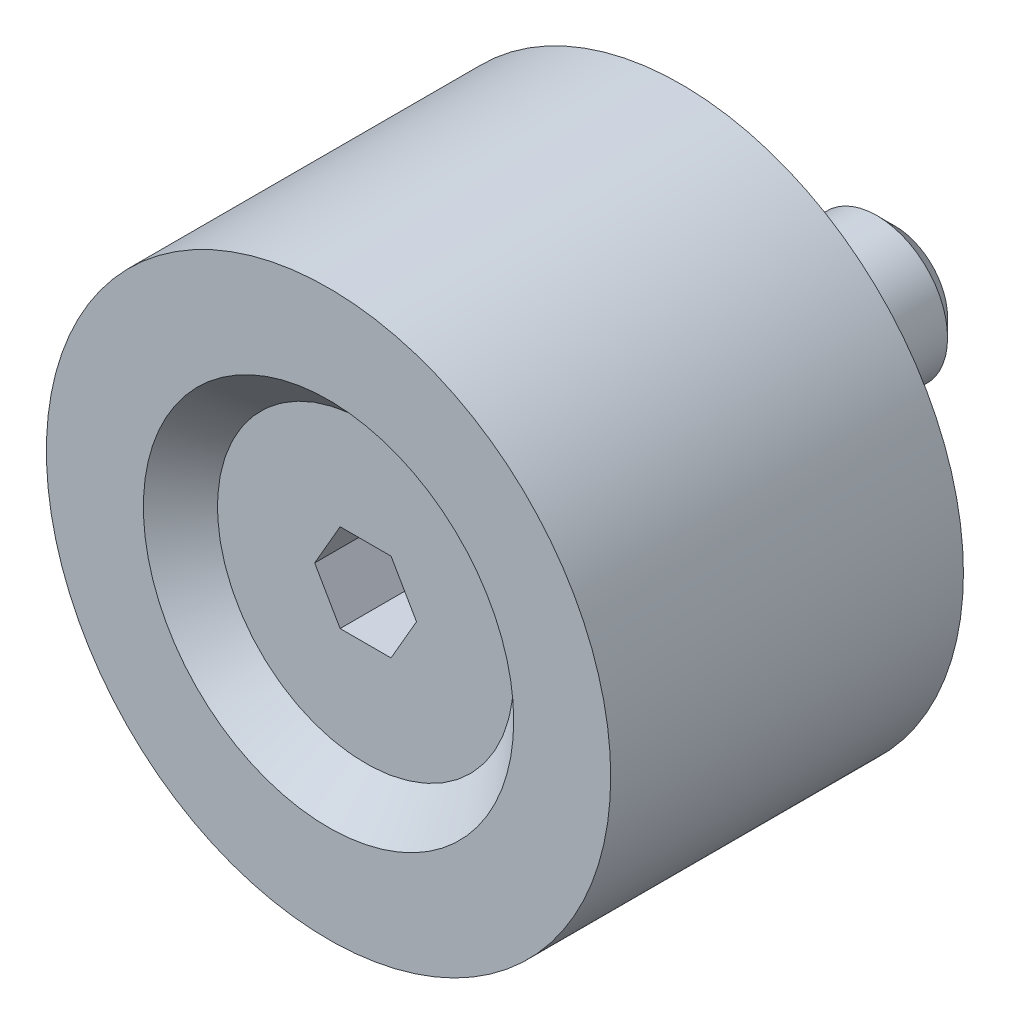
ISO-10303-21;
HEADER;
FILE_DESCRIPTION(('STEP AP214'),'2;1');
FILE_NAME('part.step','',(''),(''),'','','');
FILE_SCHEMA(('AUTOMOTIVE_DESIGN { 1 0 10303 214 1 1 1 1 }'));
ENDSEC;
DATA;
#1=APPLICATION_CONTEXT('core data for automotive mechanical design processes');
#2=APPLICATION_PROTOCOL_DEFINITION('international standard','automotive_design',2000,#1);
#3=PRODUCT_CONTEXT('',#1,'mechanical');
#4=PRODUCT('Part','Part','',(#3));
#5=PRODUCT_RELATED_PRODUCT_CATEGORY('part','',(#4));
#6=PRODUCT_DEFINITION_FORMATION('','',#4);
#7=PRODUCT_DEFINITION_CONTEXT('part definition',#1,'design');
#8=PRODUCT_DEFINITION('design','',#6,#7);
#9=PRODUCT_DEFINITION_SHAPE('','',#8);
#10=(LENGTH_UNIT() NAMED_UNIT(*) SI_UNIT(.MILLI.,.METRE.));
#11=(NAMED_UNIT(*) PLANE_ANGLE_UNIT() SI_UNIT($,.RADIAN.));
#12=(NAMED_UNIT(*) SI_UNIT($,.STERADIAN.) SOLID_ANGLE_UNIT());
#13=UNCERTAINTY_MEASURE_WITH_UNIT(LENGTH_MEASURE(1.E-05),#10,'distance_accuracy_value','');
#14=(GEOMETRIC_REPRESENTATION_CONTEXT(3) GLOBAL_UNCERTAINTY_ASSIGNED_CONTEXT((#13)) GLOBAL_UNIT_ASSIGNED_CONTEXT((#10,
#11,#12)) REPRESENTATION_CONTEXT('',''));
#15=CARTESIAN_POINT('',(0.,0.,0.));
#16=DIRECTION('',(0.,0.,1.));
#17=DIRECTION('',(1.,0.,0.));
#18=AXIS2_PLACEMENT_3D('',#15,#16,#17);
#19=CARTESIAN_POINT('',(0.,0.,3.5));
#20=DIRECTION('',(0.,0.,1.));
#21=DIRECTION('',(1.,0.,0.));
#22=AXIS2_PLACEMENT_3D('',#19,#20,#21);
#23=CYLINDRICAL_SURFACE('',#22,2.25);
#24=CARTESIAN_POINT('',(0.,0.,0.));
#25=DIRECTION('',(0.,0.,1.));
#26=DIRECTION('',(1.,0.,0.));
#27=AXIS2_PLACEMENT_3D('',#24,#25,#26);
#28=CIRCLE('',#27,2.25);
#29=CARTESIAN_POINT('',(2.25,0.,0.));
#30=VERTEX_POINT('',#29);
#31=EDGE_CURVE('P0_E37',#30,#30,#28,.T.);
#32=ORIENTED_EDGE('',*,*,#31,.F.);
#33=CARTESIAN_POINT('',(2.25,0.,1.33514124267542E-06));
#34=CARTESIAN_POINT('',(2.25,0.,6.99999973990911));
#35=B_SPLINE_CURVE_WITH_KNOTS('',1,(#33,#34),.UNSPECIFIED.,.F.,.F.,(2,2),(0.0833334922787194,
0.916666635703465),.UNSPECIFIED.);
#36=CARTESIAN_POINT('',(2.25,0.,7.));
#37=VERTEX_POINT('',#36);
#38=EDGE_CURVE('P0_E25',#30,#37,#35,.T.);
#39=ORIENTED_EDGE('',*,*,#38,.T.);
#40=CARTESIAN_POINT('',(0.,0.,7.));
#41=DIRECTION('',(0.,0.,1.));
#42=DIRECTION('',(1.,0.,0.));
#43=AXIS2_PLACEMENT_3D('',#40,#41,#42);
#44=CIRCLE('',#43,2.25);
#45=EDGE_CURVE('P0_E11',#37,#37,#44,.T.);
#46=ORIENTED_EDGE('',*,*,#45,.T.);
#47=ORIENTED_EDGE('',*,*,#38,.F.);
#48=EDGE_LOOP('',(#32,#39,#46,#47));
#49=FACE_BOUND('',#48,.T.);
#50=ADVANCED_FACE('P0_F16',(#49),#23,.F.);
#51=CARTESIAN_POINT('',(0.,0.,4.75));
#52=DIRECTION('',(0.,0.,1.));
#53=DIRECTION('',(1.,0.,0.));
#54=AXIS2_PLACEMENT_3D('',#51,#52,#53);
#55=CONICAL_SURFACE('',#54,0.,0.785398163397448);
#56=CARTESIAN_POINT('',(0.,0.,10.));
#57=DIRECTION('',(0.,0.,-1.));
#58=DIRECTION('',(1.,0.,0.));
#59=AXIS2_PLACEMENT_3D('',#56,#57,#58);
#60=CIRCLE('',#59,5.25);
#61=CARTESIAN_POINT('',(5.25,0.,10.));
#62=VERTEX_POINT('',#61);
#63=EDGE_CURVE('P0_E76',#62,#62,#60,.T.);
#64=ORIENTED_EDGE('',*,*,#63,.F.);
#65=CARTESIAN_POINT('',(5.25000283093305,0.,10.0000028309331));
#66=CARTESIAN_POINT('',(2.25000121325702,0.,7.00000121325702));
#67=B_SPLINE_CURVE_WITH_KNOTS('',1,(#65,#66),.UNSPECIFIED.,.F.,.F.,(2,2),(0.292892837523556,
0.696954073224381),.UNSPECIFIED.);
#68=EDGE_CURVE('P0_E62',#62,#37,#67,.T.);
#69=ORIENTED_EDGE('',*,*,#68,.T.);
#70=ORIENTED_EDGE('',*,*,#45,.F.);
#71=ORIENTED_EDGE('',*,*,#68,.F.);
#72=EDGE_LOOP('',(#64,#69,#70,#71));
#73=FACE_BOUND('',#72,.T.);
#74=ADVANCED_FACE('P0_F110',(#73),#55,.F.);
#75=CARTESIAN_POINT('',(0.,0.,5.));
#76=DIRECTION('',(0.,0.,1.));
#77=DIRECTION('',(1.,0.,0.));
#78=AXIS2_PLACEMENT_3D('',#75,#76,#77);
#79=CYLINDRICAL_SURFACE('',#78,8.);
#80=CARTESIAN_POINT('',(0.,0.,0.));
#81=DIRECTION('',(0.,0.,-1.));
#82=DIRECTION('',(1.,0.,0.));
#83=AXIS2_PLACEMENT_3D('',#80,#81,#82);
#84=CIRCLE('',#83,8.);
#85=CARTESIAN_POINT('',(8.,0.,0.));
#86=VERTEX_POINT('',#85);
#87=EDGE_CURVE('P0_E55',#86,#86,#84,.T.);
#88=ORIENTED_EDGE('',*,*,#87,.F.);
#89=CARTESIAN_POINT('',(8.,0.,-1.52588690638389E-06));
#90=CARTESIAN_POINT('',(8.,0.,9.99999871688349));
#91=B_SPLINE_CURVE_WITH_KNOTS('',1,(#89,#90),.UNSPECIFIED.,.F.,.F.,(2,2),(0.0833332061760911,
0.916666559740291),.UNSPECIFIED.);
#92=CARTESIAN_POINT('',(8.,0.,10.));
#93=VERTEX_POINT('',#92);
#94=EDGE_CURVE('P0_E52',#86,#93,#91,.T.);
#95=ORIENTED_EDGE('',*,*,#94,.T.);
#96=CARTESIAN_POINT('',(0.,0.,10.));
#97=DIRECTION('',(0.,0.,1.));
#98=DIRECTION('',(1.,0.,0.));
#99=AXIS2_PLACEMENT_3D('',#96,#97,#98);
#100=CIRCLE('',#99,8.);
#101=EDGE_CURVE('P0_E50',#93,#93,#100,.T.);
#102=ORIENTED_EDGE('',*,*,#101,.F.);
#103=ORIENTED_EDGE('',*,*,#94,.F.);
#104=EDGE_LOOP('',(#88,#95,#102,#103));
#105=FACE_BOUND('',#104,.T.);
#106=ADVANCED_FACE('P0_F51',(#105),#79,.T.);
#107=CARTESIAN_POINT('',(10.4,-16.6276877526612,0.));
#108=DIRECTION('',(0.,0.,-1.));
#109=DIRECTION('',(-1.,0.,0.));
#110=AXIS2_PLACEMENT_3D('',#107,#108,#109);
#111=PLANE('',#110);
#112=ORIENTED_EDGE('',*,*,#87,.T.);
#113=EDGE_LOOP('',(#112));
#114=FACE_BOUND('',#113,.T.);
#115=ORIENTED_EDGE('',*,*,#31,.T.);
#116=EDGE_LOOP('',(#115));
#117=FACE_BOUND('',#116,.T.);
#118=ADVANCED_FACE('P0_F114',(#114,#117),#111,.T.);
#119=CARTESIAN_POINT('',(-18.4,-16.6276877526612,10.));
#120=DIRECTION('',(0.,0.,1.));
#121=DIRECTION('',(1.,0.,0.));
#122=AXIS2_PLACEMENT_3D('',#119,#120,#121);
#123=PLANE('',#122);
#124=ORIENTED_EDGE('',*,*,#101,.T.);
#125=EDGE_LOOP('',(#124));
#126=FACE_BOUND('',#125,.T.);
#127=ORIENTED_EDGE('',*,*,#63,.T.);
#128=EDGE_LOOP('',(#127));
#129=FACE_BOUND('',#128,.T.);
#130=ADVANCED_FACE('P0_F112',(#126,#129),#123,.T.);
#131=CLOSED_SHELL('',(#50,#74,#106,#118,#130));
#132=MANIFOLD_SOLID_BREP('P0_B1',#131);
#133=CARTESIAN_POINT('',(0.,0.,-4.72157287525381));
#134=DIRECTION('',(0.,0.,1.));
#135=DIRECTION('',(1.,0.,0.));
#136=AXIS2_PLACEMENT_3D('',#133,#134,#135);
#137=CONICAL_SURFACE('',#136,2.82842712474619,0.785398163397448);
#138=CARTESIAN_POINT('',(0.,0.,-6.05));
#139=DIRECTION('',(0.,0.,1.));
#140=DIRECTION('',(-1.,0.,0.));
#141=AXIS2_PLACEMENT_3D('',#138,#139,#140);
#142=CIRCLE('',#141,1.5);
#143=CARTESIAN_POINT('',(-1.5,0.,-6.05));
#144=VERTEX_POINT('',#143);
#145=CARTESIAN_POINT('',(1.5,0.,-6.05));
#146=VERTEX_POINT('',#145);
#147=EDGE_CURVE('P1_E39',#144,#146,#142,.T.);
#148=ORIENTED_EDGE('',*,*,#147,.T.);
#149=CARTESIAN_POINT('',(1.49999892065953,0.,-6.05000107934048));
#150=CARTESIAN_POINT('',(2.00000070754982,0.,-5.54999929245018));
#151=B_SPLINE_CURVE_WITH_KNOTS('',1,(#149,#150),.UNSPECIFIED.,.F.,.F.,(2,2),(0.530329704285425,
0.707107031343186),.UNSPECIFIED.);
#152=CARTESIAN_POINT('',(2.,0.,-5.55));
#153=VERTEX_POINT('',#152);
#154=EDGE_CURVE('P1_E24',#146,#153,#151,.T.);
#155=ORIENTED_EDGE('',*,*,#154,.T.);
#156=CARTESIAN_POINT('',(0.,0.,-5.55));
#157=DIRECTION('',(0.,0.,-1.));
#158=DIRECTION('',(-1.,0.,0.));
#159=AXIS2_PLACEMENT_3D('',#156,#157,#158);
#160=CIRCLE('',#159,2.);
#161=CARTESIAN_POINT('',(-2.,0.,-5.55));
#162=VERTEX_POINT('',#161);
#163=EDGE_CURVE('P1_E111',#153,#162,#160,.T.);
#164=ORIENTED_EDGE('',*,*,#163,.T.);
#165=CARTESIAN_POINT('',(0.,0.,-5.55));
#166=DIRECTION('',(0.,0.,-1.));
#167=DIRECTION('',(-1.,0.,0.));
#168=AXIS2_PLACEMENT_3D('',#165,#166,#167);
#169=CIRCLE('',#168,2.);
#170=EDGE_CURVE('P1_E10',#162,#153,#169,.T.);
#171=ORIENTED_EDGE('',*,*,#170,.T.);
#172=ORIENTED_EDGE('',*,*,#154,.F.);
#173=CARTESIAN_POINT('',(0.,0.,-6.05));
#174=DIRECTION('',(0.,0.,1.));
#175=DIRECTION('',(-1.,0.,0.));
#176=AXIS2_PLACEMENT_3D('',#173,#174,#175);
#177=CIRCLE('',#176,1.5);
#178=EDGE_CURVE('P1_E106',#146,#144,#177,.T.);
#179=ORIENTED_EDGE('',*,*,#178,.T.);
#180=EDGE_LOOP('',(#148,#155,#164,#171,#172,#179));
#181=FACE_BOUND('',#180,.T.);
#182=ADVANCED_FACE('P1_F15',(#181),#137,.T.);
#183=CARTESIAN_POINT('',(0.,0.,1.45));
#184=DIRECTION('',(0.,0.,-1.));
#185=DIRECTION('',(-1.,0.,0.));
#186=AXIS2_PLACEMENT_3D('',#183,#184,#185);
#187=CYLINDRICAL_SURFACE('',#186,2.);
#188=CARTESIAN_POINT('',(0.,0.,6.75));
#189=DIRECTION('',(0.,0.,1.));
#190=DIRECTION('',(1.,0.,0.));
#191=AXIS2_PLACEMENT_3D('',#188,#189,#190);
#192=CIRCLE('',#191,2.);
#193=CARTESIAN_POINT('',(-2.,0.,6.75));
#194=VERTEX_POINT('',#193);
#195=CARTESIAN_POINT('',(2.,0.,6.75));
#196=VERTEX_POINT('',#195);
#197=EDGE_CURVE('P1_E97',#194,#196,#192,.T.);
#198=ORIENTED_EDGE('',*,*,#197,.F.);
#199=CARTESIAN_POINT('',(-2.,0.,6.74999906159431));
#200=CARTESIAN_POINT('',(-2.,0.,-5.55000125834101));
#201=B_SPLINE_CURVE_WITH_KNOTS('',1,(#199,#200),.UNSPECIFIED.,.F.,.F.,(2,2),(0.0833333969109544,
0.916666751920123),.UNSPECIFIED.);
#202=EDGE_CURVE('P1_E32',#194,#162,#201,.T.);
#203=ORIENTED_EDGE('',*,*,#202,.T.);
#204=ORIENTED_EDGE('',*,*,#163,.F.);
#205=ORIENTED_EDGE('',*,*,#170,.F.);
#206=ORIENTED_EDGE('',*,*,#202,.F.);
#207=CARTESIAN_POINT('',(0.,0.,6.75));
#208=DIRECTION('',(0.,0.,1.));
#209=DIRECTION('',(1.,0.,0.));
#210=AXIS2_PLACEMENT_3D('',#207,#208,#209);
#211=CIRCLE('',#210,2.);
#212=EDGE_CURVE('P1_E93',#196,#194,#211,.T.);
#213=ORIENTED_EDGE('',*,*,#212,.F.);
#214=EDGE_LOOP('',(#198,#203,#204,#205,#206,#213));
#215=FACE_BOUND('',#214,.T.);
#216=ADVANCED_FACE('P1_F100',(#215),#187,.T.);
#217=CARTESIAN_POINT('',(3.45,-3.11769145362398,-6.05));
#218=DIRECTION('',(0.,0.,-1.));
#219=DIRECTION('',(-1.,0.,0.));
#220=AXIS2_PLACEMENT_3D('',#217,#218,#219);
#221=PLANE('',#220);
#222=ORIENTED_EDGE('',*,*,#178,.F.);
#223=ORIENTED_EDGE('',*,*,#147,.F.);
#224=EDGE_LOOP('',(#222,#223));
#225=FACE_BOUND('',#224,.T.);
#226=ADVANCED_FACE('P1_F264',(#225),#221,.T.);
#227=CARTESIAN_POINT('',(-0.866025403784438,1.25,9.15));
#228=DIRECTION('',(0.,1.,0.));
#229=DIRECTION('',(1.,0.,0.));
#230=AXIS2_PLACEMENT_3D('',#227,#228,#229);
#231=PLANE('',#230);
#232=DIRECTION('',(-1.,0.,0.));
#233=VECTOR('',#232,1.);
#234=CARTESIAN_POINT('',(0.721687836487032,1.25,6.95));
#235=LINE('',#234,#233);
#236=CARTESIAN_POINT('',(0.721687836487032,1.25,6.95));
#237=VERTEX_POINT('',#236);
#238=CARTESIAN_POINT('',(-0.721687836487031,1.25,6.95));
#239=VERTEX_POINT('',#238);
#240=EDGE_CURVE('P1_E103',#237,#239,#235,.T.);
#241=ORIENTED_EDGE('',*,*,#240,.F.);
#242=DIRECTION('',(0.,0.,-1.));
#243=VECTOR('',#242,1.);
#244=CARTESIAN_POINT('',(0.721687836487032,1.25,8.95));
#245=LINE('',#244,#243);
#246=CARTESIAN_POINT('',(0.721687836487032,1.25,8.95));
#247=VERTEX_POINT('',#246);
#248=EDGE_CURVE('P1_E247',#247,#237,#245,.T.);
#249=ORIENTED_EDGE('',*,*,#248,.F.);
#250=DIRECTION('',(1.,0.,0.));
#251=VECTOR('',#250,1.);
#252=CARTESIAN_POINT('',(-0.721687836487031,1.25,8.95));
#253=LINE('',#252,#251);
#254=CARTESIAN_POINT('',(-0.721687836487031,1.25,8.95));
#255=VERTEX_POINT('',#254);
#256=EDGE_CURVE('P1_E241',#255,#247,#253,.T.);
#257=ORIENTED_EDGE('',*,*,#256,.F.);
#258=DIRECTION('',(0.,0.,-1.));
#259=VECTOR('',#258,1.);
#260=CARTESIAN_POINT('',(-0.721687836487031,1.25,8.95));
#261=LINE('',#260,#259);
#262=EDGE_CURVE('P1_E236',#255,#239,#261,.T.);
#263=ORIENTED_EDGE('',*,*,#262,.T.);
#264=EDGE_LOOP('',(#241,#249,#257,#263));
#265=FACE_BOUND('',#264,.T.);
#266=ADVANCED_FACE('P1_F266',(#265),#231,.F.);
#267=CARTESIAN_POINT('',(-1.51554445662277,-0.124999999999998,9.15));
#268=DIRECTION('',(-0.866025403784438,0.500000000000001,0.));
#269=DIRECTION('',(0.500000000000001,0.866025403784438,0.));
#270=AXIS2_PLACEMENT_3D('',#267,#268,#269);
#271=PLANE('',#270);
#272=DIRECTION('',(-0.500000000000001,-0.866025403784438,0.));
#273=VECTOR('',#272,1.);
#274=CARTESIAN_POINT('',(-0.721687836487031,1.25,6.95));
#275=LINE('',#274,#273);
#276=CARTESIAN_POINT('',(-1.44337567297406,0.,6.95));
#277=VERTEX_POINT('',#276);
#278=EDGE_CURVE('P1_E230',#239,#277,#275,.T.);
#279=ORIENTED_EDGE('',*,*,#278,.F.);
#280=ORIENTED_EDGE('',*,*,#262,.F.);
#281=DIRECTION('',(0.500000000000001,0.866025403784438,0.));
#282=VECTOR('',#281,1.);
#283=CARTESIAN_POINT('',(-1.44337567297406,0.,8.95));
#284=LINE('',#283,#282);
#285=CARTESIAN_POINT('',(-1.44337567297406,0.,8.95));
#286=VERTEX_POINT('',#285);
#287=EDGE_CURVE('P1_E224',#286,#255,#284,.T.);
#288=ORIENTED_EDGE('',*,*,#287,.F.);
#289=DIRECTION('',(0.,0.,-1.));
#290=VECTOR('',#289,1.);
#291=CARTESIAN_POINT('',(-1.44337567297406,0.,8.95));
#292=LINE('',#291,#290);
#293=EDGE_CURVE('P1_E219',#286,#277,#292,.T.);
#294=ORIENTED_EDGE('',*,*,#293,.T.);
#295=EDGE_LOOP('',(#279,#280,#288,#294));
#296=FACE_BOUND('',#295,.T.);
#297=ADVANCED_FACE('P1_F273',(#296),#271,.F.);
#298=CARTESIAN_POINT('',(-0.649519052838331,-1.375,9.15));
#299=DIRECTION('',(-0.866025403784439,-0.499999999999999,0.));
#300=DIRECTION('',(-0.499999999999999,0.866025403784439,0.));
#301=AXIS2_PLACEMENT_3D('',#298,#299,#300);
#302=PLANE('',#301);
#303=DIRECTION('',(0.499999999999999,-0.866025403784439,0.));
#304=VECTOR('',#303,1.);
#305=CARTESIAN_POINT('',(-1.44337567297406,0.,6.95));
#306=LINE('',#305,#304);
#307=CARTESIAN_POINT('',(-0.721687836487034,-1.25,6.95));
#308=VERTEX_POINT('',#307);
#309=EDGE_CURVE('P1_E213',#277,#308,#306,.T.);
#310=ORIENTED_EDGE('',*,*,#309,.F.);
#311=ORIENTED_EDGE('',*,*,#293,.F.);
#312=DIRECTION('',(-0.499999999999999,0.866025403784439,0.));
#313=VECTOR('',#312,1.);
#314=CARTESIAN_POINT('',(-0.721687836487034,-1.25,8.95));
#315=LINE('',#314,#313);
#316=CARTESIAN_POINT('',(-0.721687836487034,-1.25,8.95));
#317=VERTEX_POINT('',#316);
#318=EDGE_CURVE('P1_E207',#317,#286,#315,.T.);
#319=ORIENTED_EDGE('',*,*,#318,.F.);
#320=DIRECTION('',(0.,0.,-1.));
#321=VECTOR('',#320,1.);
#322=CARTESIAN_POINT('',(-0.721687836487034,-1.25,8.95));
#323=LINE('',#322,#321);
#324=EDGE_CURVE('P1_E202',#317,#308,#323,.T.);
#325=ORIENTED_EDGE('',*,*,#324,.T.);
#326=EDGE_LOOP('',(#310,#311,#319,#325));
#327=FACE_BOUND('',#326,.T.);
#328=ADVANCED_FACE('P1_F309',(#327),#302,.F.);
#329=CARTESIAN_POINT('',(0.866025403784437,-1.25,9.15));
#330=DIRECTION('',(0.,-1.,0.));
#331=DIRECTION('',(-1.,0.,0.));
#332=AXIS2_PLACEMENT_3D('',#329,#330,#331);
#333=PLANE('',#332);
#334=DIRECTION('',(1.,0.,0.));
#335=VECTOR('',#334,1.);
#336=CARTESIAN_POINT('',(-0.721687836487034,-1.25,6.95));
#337=LINE('',#336,#335);
#338=CARTESIAN_POINT('',(0.721687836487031,-1.25,6.95));
#339=VERTEX_POINT('',#338);
#340=EDGE_CURVE('P1_E196',#308,#339,#337,.T.);
#341=ORIENTED_EDGE('',*,*,#340,.F.);
#342=ORIENTED_EDGE('',*,*,#324,.F.);
#343=DIRECTION('',(-1.,0.,0.));
#344=VECTOR('',#343,1.);
#345=CARTESIAN_POINT('',(0.721687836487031,-1.25,8.95));
#346=LINE('',#345,#344);
#347=CARTESIAN_POINT('',(0.721687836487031,-1.25,8.95));
#348=VERTEX_POINT('',#347);
#349=EDGE_CURVE('P1_E190',#348,#317,#346,.T.);
#350=ORIENTED_EDGE('',*,*,#349,.F.);
#351=DIRECTION('',(0.,0.,-1.));
#352=VECTOR('',#351,1.);
#353=CARTESIAN_POINT('',(0.721687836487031,-1.25,8.95));
#354=LINE('',#353,#352);
#355=EDGE_CURVE('P1_E185',#348,#339,#354,.T.);
#356=ORIENTED_EDGE('',*,*,#355,.T.);
#357=EDGE_LOOP('',(#341,#342,#350,#356));
#358=FACE_BOUND('',#357,.T.);
#359=ADVANCED_FACE('P1_F317',(#358),#333,.F.);
#360=CARTESIAN_POINT('',(1.51554445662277,0.124999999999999,9.15));
#361=DIRECTION('',(0.866025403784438,-0.5,0.));
#362=DIRECTION('',(-0.5,-0.866025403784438,0.));
#363=AXIS2_PLACEMENT_3D('',#360,#361,#362);
#364=PLANE('',#363);
#365=DIRECTION('',(0.5,0.866025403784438,0.));
#366=VECTOR('',#365,1.);
#367=CARTESIAN_POINT('',(0.721687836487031,-1.25,6.95));
#368=LINE('',#367,#366);
#369=CARTESIAN_POINT('',(1.44337567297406,0.,6.95));
#370=VERTEX_POINT('',#369);
#371=EDGE_CURVE('P1_E179',#339,#370,#368,.T.);
#372=ORIENTED_EDGE('',*,*,#371,.F.);
#373=ORIENTED_EDGE('',*,*,#355,.F.);
#374=DIRECTION('',(-0.500000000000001,-0.866025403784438,0.));
#375=VECTOR('',#374,1.);
#376=CARTESIAN_POINT('',(1.44337567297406,0.,8.95));
#377=LINE('',#376,#375);
#378=CARTESIAN_POINT('',(1.44337567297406,0.,8.95));
#379=VERTEX_POINT('',#378);
#380=EDGE_CURVE('P1_E173',#379,#348,#377,.T.);
#381=ORIENTED_EDGE('',*,*,#380,.F.);
#382=DIRECTION('',(0.,0.,-1.));
#383=VECTOR('',#382,1.);
#384=CARTESIAN_POINT('',(1.44337567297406,0.,8.95));
#385=LINE('',#384,#383);
#386=EDGE_CURVE('P1_E168',#379,#370,#385,.T.);
#387=ORIENTED_EDGE('',*,*,#386,.T.);
#388=EDGE_LOOP('',(#372,#373,#381,#387));
#389=FACE_BOUND('',#388,.T.);
#390=ADVANCED_FACE('P1_F326',(#389),#364,.F.);
#391=CARTESIAN_POINT('',(0.649519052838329,1.375,9.15));
#392=DIRECTION('',(0.866025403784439,0.5,0.));
#393=DIRECTION('',(0.5,-0.866025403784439,0.));
#394=AXIS2_PLACEMENT_3D('',#391,#392,#393);
#395=PLANE('',#394);
#396=DIRECTION('',(-0.5,0.866025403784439,0.));
#397=VECTOR('',#396,1.);
#398=CARTESIAN_POINT('',(1.44337567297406,0.,6.95));
#399=LINE('',#398,#397);
#400=EDGE_CURVE('P1_E162',#370,#237,#399,.T.);
#401=ORIENTED_EDGE('',*,*,#400,.F.);
#402=ORIENTED_EDGE('',*,*,#386,.F.);
#403=DIRECTION('',(0.5,-0.866025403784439,0.));
#404=VECTOR('',#403,1.);
#405=CARTESIAN_POINT('',(0.721687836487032,1.25,8.95));
#406=LINE('',#405,#404);
#407=EDGE_CURVE('P1_E117',#247,#379,#406,.T.);
#408=ORIENTED_EDGE('',*,*,#407,.F.);
#409=ORIENTED_EDGE('',*,*,#248,.T.);
#410=EDGE_LOOP('',(#401,#402,#408,#409));
#411=FACE_BOUND('',#410,.T.);
#412=ADVANCED_FACE('P1_F335',(#411),#395,.F.);
#413=CARTESIAN_POINT('',(1.73205080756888,-1.5,6.95));
#414=DIRECTION('',(0.,0.,-1.));
#415=DIRECTION('',(-1.,0.,0.));
#416=AXIS2_PLACEMENT_3D('',#413,#414,#415);
#417=PLANE('',#416);
#418=ORIENTED_EDGE('',*,*,#240,.T.);
#419=ORIENTED_EDGE('',*,*,#278,.T.);
#420=ORIENTED_EDGE('',*,*,#309,.T.);
#421=ORIENTED_EDGE('',*,*,#340,.T.);
#422=ORIENTED_EDGE('',*,*,#371,.T.);
#423=ORIENTED_EDGE('',*,*,#400,.T.);
#424=EDGE_LOOP('',(#418,#419,#420,#421,#422,#423));
#425=FACE_BOUND('',#424,.T.);
#426=ADVANCED_FACE('P1_F344',(#425),#417,.F.);
#427=CARTESIAN_POINT('',(0.,0.,8.95));
#428=DIRECTION('',(0.,0.,1.));
#429=DIRECTION('',(-1.,0.,0.));
#430=AXIS2_PLACEMENT_3D('',#427,#428,#429);
#431=CONICAL_SURFACE('',#430,4.2,0.785398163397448);
#432=ORIENTED_EDGE('',*,*,#212,.T.);
#433=CARTESIAN_POINT('',(-2.,0.,6.75));
#434=CARTESIAN_POINT('',(-4.2,0.,8.95));
#435=B_SPLINE_CURVE_WITH_KNOTS('',1,(#433,#434),.UNSPECIFIED.,.F.,.F.,(2,2),(0.,1.),.UNSPECIFIED.);
#436=CARTESIAN_POINT('',(-4.2,0.,8.95));
#437=VERTEX_POINT('',#436);
#438=EDGE_CURVE('P1_E96',#194,#437,#435,.T.);
#439=ORIENTED_EDGE('',*,*,#438,.T.);
#440=CARTESIAN_POINT('',(0.,0.,8.95));
#441=DIRECTION('',(0.,0.,1.));
#442=DIRECTION('',(-1.,0.,0.));
#443=AXIS2_PLACEMENT_3D('',#440,#441,#442);
#444=CIRCLE('',#443,4.2);
#445=EDGE_CURVE('P1_E109',#437,#437,#444,.T.);
#446=ORIENTED_EDGE('',*,*,#445,.F.);
#447=ORIENTED_EDGE('',*,*,#438,.F.);
#448=ORIENTED_EDGE('',*,*,#197,.T.);
#449=EDGE_LOOP('',(#432,#439,#446,#447,#448));
#450=FACE_BOUND('',#449,.T.);
#451=ADVANCED_FACE('P1_F94',(#450),#431,.T.);
#452=CARTESIAN_POINT('',(-5.46,-8.72953607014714,8.95));
#453=DIRECTION('',(0.,0.,1.));
#454=DIRECTION('',(1.,0.,0.));
#455=AXIS2_PLACEMENT_3D('',#452,#453,#454);
#456=PLANE('',#455);
#457=ORIENTED_EDGE('',*,*,#445,.T.);
#458=EDGE_LOOP('',(#457));
#459=FACE_BOUND('',#458,.T.);
#460=ORIENTED_EDGE('',*,*,#256,.T.);
#461=ORIENTED_EDGE('',*,*,#407,.T.);
#462=ORIENTED_EDGE('',*,*,#380,.T.);
#463=ORIENTED_EDGE('',*,*,#349,.T.);
#464=ORIENTED_EDGE('',*,*,#318,.T.);
#465=ORIENTED_EDGE('',*,*,#287,.T.);
#466=EDGE_LOOP('',(#460,#461,#462,#463,#464,#465));
#467=FACE_BOUND('',#466,.T.);
#468=ADVANCED_FACE('P1_F361',(#459,#467),#456,.T.);
#469=CLOSED_SHELL('',(#182,#216,#226,#266,#297,#328,#359,#390,#412,#426,#451,#468));
#470=MANIFOLD_SOLID_BREP('P1_B1',#469);
#471=ADVANCED_BREP_SHAPE_REPRESENTATION('',(#18,#132,#470),#14);
#472=SHAPE_DEFINITION_REPRESENTATION(#9,#471);
ENDSEC;
END-ISO-10303-21;
